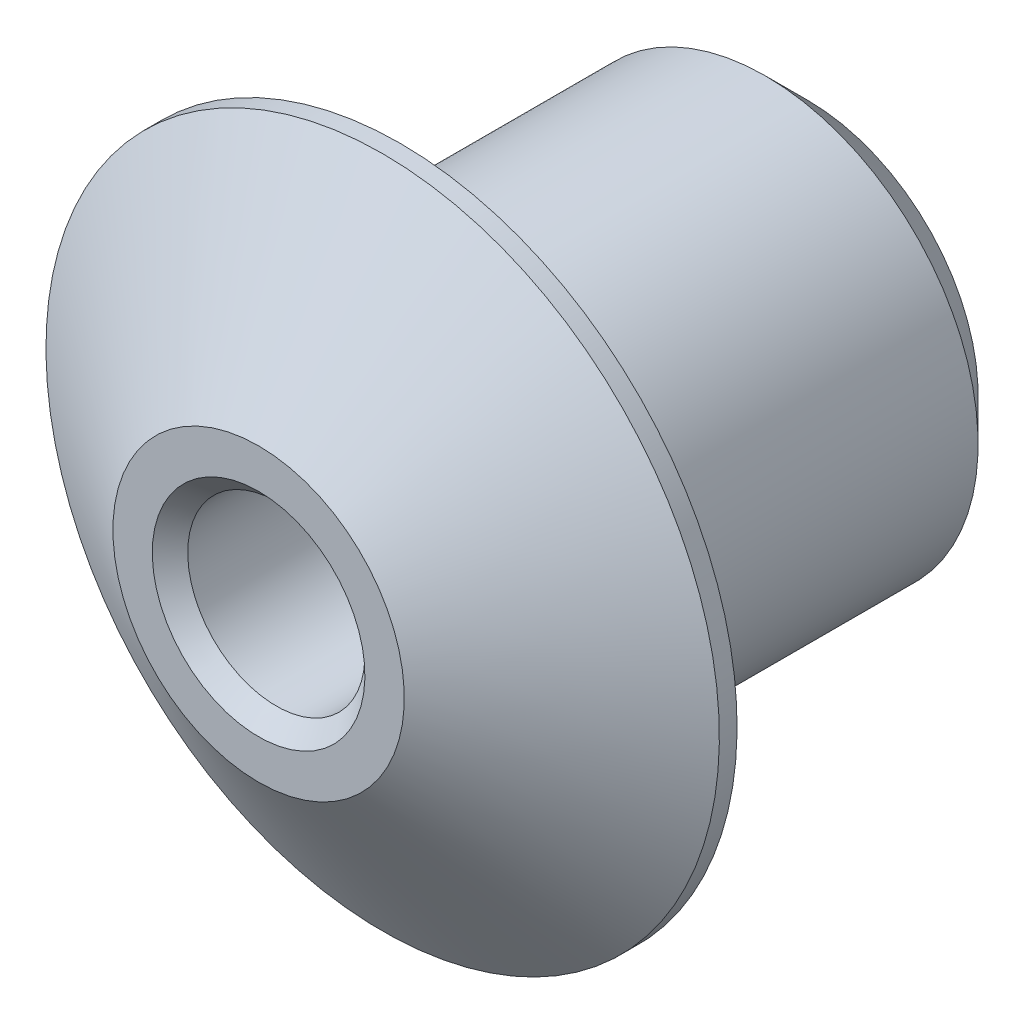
ISO-10303-21;
HEADER;
FILE_DESCRIPTION(('STEP AP214'),'2;1');
FILE_NAME('part.step','',(''),(''),'','','');
FILE_SCHEMA(('AUTOMOTIVE_DESIGN { 1 0 10303 214 1 1 1 1 }'));
ENDSEC;
DATA;
#1=APPLICATION_CONTEXT('core data for automotive mechanical design processes');
#2=APPLICATION_PROTOCOL_DEFINITION('international standard','automotive_design',2000,#1);
#3=PRODUCT_CONTEXT('',#1,'mechanical');
#4=PRODUCT('Part','Part','',(#3));
#5=PRODUCT_RELATED_PRODUCT_CATEGORY('part','',(#4));
#6=PRODUCT_DEFINITION_FORMATION('','',#4);
#7=PRODUCT_DEFINITION_CONTEXT('part definition',#1,'design');
#8=PRODUCT_DEFINITION('design','',#6,#7);
#9=PRODUCT_DEFINITION_SHAPE('','',#8);
#10=(LENGTH_UNIT() NAMED_UNIT(*) SI_UNIT(.MILLI.,.METRE.));
#11=(NAMED_UNIT(*) PLANE_ANGLE_UNIT() SI_UNIT($,.RADIAN.));
#12=(NAMED_UNIT(*) SI_UNIT($,.STERADIAN.) SOLID_ANGLE_UNIT());
#13=UNCERTAINTY_MEASURE_WITH_UNIT(LENGTH_MEASURE(1.E-05),#10,'distance_accuracy_value','');
#14=(GEOMETRIC_REPRESENTATION_CONTEXT(3) GLOBAL_UNCERTAINTY_ASSIGNED_CONTEXT((#13)) GLOBAL_UNIT_ASSIGNED_CONTEXT((#10,
#11,#12)) REPRESENTATION_CONTEXT('',''));
#15=CARTESIAN_POINT('',(0.,0.,0.));
#16=DIRECTION('',(0.,0.,1.));
#17=DIRECTION('',(1.,0.,0.));
#18=AXIS2_PLACEMENT_3D('',#15,#16,#17);
#19=CARTESIAN_POINT('',(0.,0.,-6.));
#20=DIRECTION('',(0.,0.,1.));
#21=DIRECTION('',(0.,-1.,0.));
#22=AXIS2_PLACEMENT_3D('',#19,#20,#21);
#23=CONICAL_SURFACE('',#22,2.5,0.872664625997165);
#24=CARTESIAN_POINT('',(2.,2.6451157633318,-5.31519583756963));
#25=CARTESIAN_POINT('',(2.,2.57786167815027,-5.36019912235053));
#26=CARTESIAN_POINT('',(2.,2.51032536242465,-5.40478738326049));
#27=CARTESIAN_POINT('',(2.,2.37456315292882,-5.49293207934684));
#28=CARTESIAN_POINT('',(2.,2.30633711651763,-5.53648829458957));
#29=CARTESIAN_POINT('',(2.,2.16862031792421,-5.62264719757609));
#30=CARTESIAN_POINT('',(2.,2.09912405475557,-5.66524112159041));
#31=CARTESIAN_POINT('',(2.,1.95919860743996,-5.74886273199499));
#32=CARTESIAN_POINT('',(2.,1.8887694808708,-5.7898905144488));
#33=CARTESIAN_POINT('',(2.,1.74286272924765,-5.87223695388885));
#34=CARTESIAN_POINT('',(2.,1.66732223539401,-5.91344478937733));
#35=CARTESIAN_POINT('',(2.,1.51480981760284,-5.99311608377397));
#36=CARTESIAN_POINT('',(2.,1.43783806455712,-6.03157986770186));
#37=CARTESIAN_POINT('',(2.,1.28242402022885,-6.10491089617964));
#38=CARTESIAN_POINT('',(2.,1.20398594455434,-6.13978699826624));
#39=CARTESIAN_POINT('',(2.,1.04528210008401,-6.20505682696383));
#40=CARTESIAN_POINT('',(2.,0.96501710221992,-6.23545240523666));
#41=CARTESIAN_POINT('',(2.,0.804631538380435,-6.28984541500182));
#42=CARTESIAN_POINT('',(2.,0.724560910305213,-6.31398797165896));
#43=CARTESIAN_POINT('',(2.,0.562674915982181,-6.35559635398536));
#44=CARTESIAN_POINT('',(2.,0.480859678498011,-6.37306267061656));
#45=CARTESIAN_POINT('',(2.,0.317480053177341,-6.3998403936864));
#46=CARTESIAN_POINT('',(2.,0.23594065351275,-6.4093010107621));
#47=CARTESIAN_POINT('',(2.,0.0723155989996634,-6.41984676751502));
#48=CARTESIAN_POINT('',(2.,-0.00976998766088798,-6.42093293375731));
#49=CARTESIAN_POINT('',(2.,-0.167433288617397,-6.41487856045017));
#50=CARTESIAN_POINT('',(2.,-0.243035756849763,-6.40835113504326));
#51=CARTESIAN_POINT('',(2.,-0.393338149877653,-6.38853746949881));
#52=CARTESIAN_POINT('',(2.,-0.468038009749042,-6.37525074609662));
#53=CARTESIAN_POINT('',(2.,-0.617702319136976,-6.34240168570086));
#54=CARTESIAN_POINT('',(2.,-0.692638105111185,-6.32271090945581));
#55=CARTESIAN_POINT('',(2.,-0.840916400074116,-6.27816929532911));
#56=CARTESIAN_POINT('',(2.,-0.914259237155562,-6.25331953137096));
#57=CARTESIAN_POINT('',(2.,-1.12888197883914,-6.17365164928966));
#58=CARTESIAN_POINT('',(2.,-1.2679570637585,-6.11292450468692));
#59=CARTESIAN_POINT('',(2.,-1.54119296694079,-5.98115937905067));
#60=CARTESIAN_POINT('',(2.,-1.67534617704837,-5.91010621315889));
#61=CARTESIAN_POINT('',(2.,-1.94067766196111,-5.76081388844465));
#62=CARTESIAN_POINT('',(2.,-2.07183160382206,-5.68253191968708));
#63=CARTESIAN_POINT('',(2.,-2.33119088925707,-5.52144420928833));
#64=CARTESIAN_POINT('',(2.,-2.45939795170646,-5.43864120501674));
#65=CARTESIAN_POINT('',(2.,-2.69991940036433,-5.27897701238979));
#66=CARTESIAN_POINT('',(2.,-2.81245201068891,-5.20244273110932));
#67=CARTESIAN_POINT('',(2.,-3.03621517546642,-5.04746117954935));
#68=CARTESIAN_POINT('',(2.,-3.1474455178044,-4.96901360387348));
#69=CARTESIAN_POINT('',(2.,-3.36737393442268,-4.81174090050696));
#70=CARTESIAN_POINT('',(2.,-3.47608592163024,-4.7329351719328));
#71=CARTESIAN_POINT('',(2.,-3.6926625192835,-4.57422682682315));
#72=CARTESIAN_POINT('',(2.,-3.80052734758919,-4.49432450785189));
#73=CARTESIAN_POINT('',(2.,-3.90807857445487,-4.41400821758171));
#74=B_SPLINE_CURVE_WITH_KNOTS('',3,(#24,#25,#26,#27,#28,#29,#30,#31,#32,#33,#34,#35,#36,#37,#38,
#39,#40,#41,#42,#43,#44,#45,#46,#47,#48,#49,#50,#51,#52,#53,#54,#55,#56,#57,#58,#59,#60,#61,#62,
#63,#64,#65,#66,#67,#68,#69,#70,#71,#72,#73),.UNSPECIFIED.,.F.,.F.,(4,2,2,2,2,2,2,2,2,2,2,2,2,2,
2,2,2,2,2,2,2,2,2,2,4),(0.,0.242770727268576,0.485592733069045,0.730107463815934,
0.974607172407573,1.23271036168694,1.49078292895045,1.74820223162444,2.005514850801,
2.25617358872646,2.50681388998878,2.75267286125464,2.99850169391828,3.22582565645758,
3.45316587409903,3.68538017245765,3.91754618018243,4.37205400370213,4.82723709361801,
5.28531377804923,5.74311611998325,6.15136831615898,6.55968610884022,6.9624907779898,
7.36518822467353),.UNSPECIFIED.);
#75=CARTESIAN_POINT('',(2.,1.15470053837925,-6.15993148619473));
#76=VERTEX_POINT('',#75);
#77=CARTESIAN_POINT('',(2.,-1.15470053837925,-6.15993148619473));
#78=VERTEX_POINT('',#77);
#79=EDGE_CURVE('E142',#76,#78,#74,.T.);
#80=ORIENTED_EDGE('',*,*,#79,.T.);
#81=CARTESIAN_POINT('',(2.0002,-1.15458506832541,-6.15983458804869));
#82=CARTESIAN_POINT('',(1.93287475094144,-1.19345531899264,-6.19243850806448));
#83=CARTESIAN_POINT('',(1.86472971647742,-1.23279887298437,-6.22300460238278));
#84=CARTESIAN_POINT('',(1.72660712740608,-1.31254398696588,-6.27888502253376));
#85=CARTESIAN_POINT('',(1.65662434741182,-1.3529485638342,-6.30418199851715));
#86=CARTESIAN_POINT('',(1.51571866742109,-1.4343004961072,-6.34791885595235));
#87=CARTESIAN_POINT('',(1.44481025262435,-1.47523948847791,-6.36641943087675));
#88=CARTESIAN_POINT('',(1.30186028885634,-1.55777168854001,-6.39559665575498));
#89=CARTESIAN_POINT('',(1.22982023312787,-1.59936403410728,-6.40628285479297));
#90=CARTESIAN_POINT('',(1.0839081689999,-1.68360640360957,-6.41908026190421));
#91=CARTESIAN_POINT('',(1.01002594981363,-1.7262623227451,-6.42104100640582));
#92=CARTESIAN_POINT('',(0.862481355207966,-1.81144723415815,-6.41578621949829));
#93=CARTESIAN_POINT('',(0.78881909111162,-1.8539761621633,-6.40856664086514));
#94=CARTESIAN_POINT('',(0.642524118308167,-1.93843960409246,-6.38561026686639));
#95=CARTESIAN_POINT('',(0.569891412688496,-1.98037411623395,-6.36987344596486));
#96=CARTESIAN_POINT('',(0.426099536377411,-2.06339239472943,-6.33109503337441));
#97=CARTESIAN_POINT('',(0.354941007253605,-2.1044757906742,-6.30805032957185));
#98=CARTESIAN_POINT('',(0.236290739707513,-2.17297855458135,-6.2641669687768));
#99=CARTESIAN_POINT('',(0.188354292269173,-2.20065467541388,-6.24489060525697));
#100=CARTESIAN_POINT('',(0.0934234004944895,-2.2554630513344,-6.20401277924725));
#101=CARTESIAN_POINT('',(0.0464262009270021,-2.28259689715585,-6.18241987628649));
#102=CARTESIAN_POINT('',(-0.000200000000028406,-2.30951654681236,-6.15983458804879));
#103=B_SPLINE_CURVE_WITH_KNOTS('',3,(#81,#82,#83,#84,#85,#86,#87,#88,#89,#90,#91,#92,#93,#94,
#95,#96,#97,#98,#99,#100,#101,#102),.UNSPECIFIED.,.F.,.F.,(4,2,2,2,2,2,2,2,2,2,4),(0.,
0.253000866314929,0.506822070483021,0.758318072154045,1.00950623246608,1.2650095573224,
1.52062556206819,1.77624233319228,2.0319681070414,2.20775392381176,2.38291123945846),.UNSPECIFIED.);
#104=CARTESIAN_POINT('',(0.,-2.30940107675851,-6.15993148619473));
#105=VERTEX_POINT('',#104);
#106=EDGE_CURVE('E104',#78,#105,#103,.T.);
#107=ORIENTED_EDGE('',*,*,#106,.T.);
#108=CARTESIAN_POINT('',(0.0002,-2.30951654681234,-6.15983458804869));
#109=CARTESIAN_POINT('',(-0.0671252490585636,-2.27064629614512,-6.19243850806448));
#110=CARTESIAN_POINT('',(-0.135270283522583,-2.23130274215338,-6.22300460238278));
#111=CARTESIAN_POINT('',(-0.273392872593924,-2.15155762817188,-6.27888502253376));
#112=CARTESIAN_POINT('',(-0.343375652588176,-2.11115305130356,-6.30418199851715));
#113=CARTESIAN_POINT('',(-0.484281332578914,-2.02980111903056,-6.34791885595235));
#114=CARTESIAN_POINT('',(-0.555189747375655,-1.98886212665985,-6.36641943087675));
#115=CARTESIAN_POINT('',(-0.698139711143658,-1.90632992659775,-6.39559665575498));
#116=CARTESIAN_POINT('',(-0.770179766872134,-1.86473758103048,-6.40628285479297));
#117=CARTESIAN_POINT('',(-0.9160918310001,-1.78049521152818,-6.41908026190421));
#118=CARTESIAN_POINT('',(-0.98997405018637,-1.73783929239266,-6.42104100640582));
#119=CARTESIAN_POINT('',(-1.13751864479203,-1.6526543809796,-6.41578621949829));
#120=CARTESIAN_POINT('',(-1.21118090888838,-1.61012545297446,-6.40856664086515));
#121=CARTESIAN_POINT('',(-1.35747588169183,-1.5256620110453,-6.3856102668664));
#122=CARTESIAN_POINT('',(-1.4301085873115,-1.48372749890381,-6.36987344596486));
#123=CARTESIAN_POINT('',(-1.57390046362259,-1.40070922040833,-6.33109503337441));
#124=CARTESIAN_POINT('',(-1.64505899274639,-1.35962582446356,-6.30805032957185));
#125=CARTESIAN_POINT('',(-1.76370926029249,-1.2911230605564,-6.2641669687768));
#126=CARTESIAN_POINT('',(-1.81164570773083,-1.26344693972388,-6.24489060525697));
#127=CARTESIAN_POINT('',(-1.90657659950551,-1.20863856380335,-6.20401277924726));
#128=CARTESIAN_POINT('',(-1.953573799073,-1.18150471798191,-6.18241987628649));
#129=CARTESIAN_POINT('',(-2.00020000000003,-1.1545850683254,-6.15983458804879));
#130=B_SPLINE_CURVE_WITH_KNOTS('',3,(#108,#109,#110,#111,#112,#113,#114,#115,#116,#117,#118,
#119,#120,#121,#122,#123,#124,#125,#126,#127,#128,#129),.UNSPECIFIED.,.F.,.F.,(4,2,2,2,2,2,2,2,
2,2,4),(0.,0.253000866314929,0.506822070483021,0.758318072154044,1.00950623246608,
1.2650095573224,1.52062556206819,1.77624233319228,2.0319681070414,2.20775392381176,
2.38291123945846),.UNSPECIFIED.);
#131=CARTESIAN_POINT('',(-2.,-1.15470053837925,-6.15993148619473));
#132=VERTEX_POINT('',#131);
#133=EDGE_CURVE('E153',#105,#132,#130,.T.);
#134=ORIENTED_EDGE('',*,*,#133,.T.);
#135=CARTESIAN_POINT('',(-2.,2.6451157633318,-5.31519583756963));
#136=CARTESIAN_POINT('',(-2.,2.57786167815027,-5.36019912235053));
#137=CARTESIAN_POINT('',(-2.,2.51032536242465,-5.40478738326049));
#138=CARTESIAN_POINT('',(-2.,2.37456315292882,-5.49293207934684));
#139=CARTESIAN_POINT('',(-2.,2.30633711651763,-5.53648829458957));
#140=CARTESIAN_POINT('',(-2.,2.16862031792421,-5.62264719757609));
#141=CARTESIAN_POINT('',(-2.,2.09912405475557,-5.66524112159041));
#142=CARTESIAN_POINT('',(-2.,1.95919860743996,-5.74886273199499));
#143=CARTESIAN_POINT('',(-2.,1.8887694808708,-5.7898905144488));
#144=CARTESIAN_POINT('',(-2.,1.74286272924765,-5.87223695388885));
#145=CARTESIAN_POINT('',(-2.,1.66732223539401,-5.91344478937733));
#146=CARTESIAN_POINT('',(-2.,1.51480981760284,-5.99311608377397));
#147=CARTESIAN_POINT('',(-2.,1.43783806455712,-6.03157986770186));
#148=CARTESIAN_POINT('',(-2.,1.28242402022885,-6.10491089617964));
#149=CARTESIAN_POINT('',(-2.,1.20398594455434,-6.13978699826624));
#150=CARTESIAN_POINT('',(-2.,1.04528210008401,-6.20505682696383));
#151=CARTESIAN_POINT('',(-2.,0.96501710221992,-6.23545240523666));
#152=CARTESIAN_POINT('',(-2.,0.804631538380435,-6.28984541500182));
#153=CARTESIAN_POINT('',(-2.,0.724560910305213,-6.31398797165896));
#154=CARTESIAN_POINT('',(-2.,0.562674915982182,-6.35559635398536));
#155=CARTESIAN_POINT('',(-2.,0.480859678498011,-6.37306267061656));
#156=CARTESIAN_POINT('',(-2.,0.317480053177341,-6.3998403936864));
#157=CARTESIAN_POINT('',(-2.,0.235940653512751,-6.4093010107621));
#158=CARTESIAN_POINT('',(-2.,0.0723155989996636,-6.41984676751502));
#159=CARTESIAN_POINT('',(-2.,-0.00976998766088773,-6.42093293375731));
#160=CARTESIAN_POINT('',(-2.,-0.167433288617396,-6.41487856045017));
#161=CARTESIAN_POINT('',(-2.,-0.243035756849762,-6.40835113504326));
#162=CARTESIAN_POINT('',(-2.,-0.393338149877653,-6.38853746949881));
#163=CARTESIAN_POINT('',(-2.,-0.468038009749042,-6.37525074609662));
#164=CARTESIAN_POINT('',(-2.,-0.617702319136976,-6.34240168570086));
#165=CARTESIAN_POINT('',(-2.,-0.692638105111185,-6.32271090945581));
#166=CARTESIAN_POINT('',(-2.,-0.840916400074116,-6.27816929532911));
#167=CARTESIAN_POINT('',(-2.,-0.914259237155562,-6.25331953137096));
#168=CARTESIAN_POINT('',(-2.,-1.12888197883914,-6.17365164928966));
#169=CARTESIAN_POINT('',(-2.,-1.2679570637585,-6.11292450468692));
#170=CARTESIAN_POINT('',(-2.,-1.54119296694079,-5.98115937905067));
#171=CARTESIAN_POINT('',(-2.,-1.67534617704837,-5.91010621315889));
#172=CARTESIAN_POINT('',(-2.,-1.94067766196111,-5.76081388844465));
#173=CARTESIAN_POINT('',(-2.,-2.07183160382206,-5.68253191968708));
#174=CARTESIAN_POINT('',(-2.,-2.33119088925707,-5.52144420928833));
#175=CARTESIAN_POINT('',(-2.,-2.45939795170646,-5.43864120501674));
#176=CARTESIAN_POINT('',(-2.,-2.69991940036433,-5.27897701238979));
#177=CARTESIAN_POINT('',(-2.,-2.81245201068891,-5.20244273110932));
#178=CARTESIAN_POINT('',(-2.,-3.03621517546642,-5.04746117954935));
#179=CARTESIAN_POINT('',(-2.,-3.1474455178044,-4.96901360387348));
#180=CARTESIAN_POINT('',(-2.,-3.36737393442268,-4.81174090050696));
#181=CARTESIAN_POINT('',(-2.,-3.47608592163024,-4.7329351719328));
#182=CARTESIAN_POINT('',(-2.,-3.6926625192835,-4.57422682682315));
#183=CARTESIAN_POINT('',(-2.,-3.80052734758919,-4.49432450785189));
#184=CARTESIAN_POINT('',(-2.,-3.90807857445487,-4.41400821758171));
#185=B_SPLINE_CURVE_WITH_KNOTS('',3,(#135,#136,#137,#138,#139,#140,#141,#142,#143,#144,#145,
#146,#147,#148,#149,#150,#151,#152,#153,#154,#155,#156,#157,#158,#159,#160,#161,#162,#163,#164,
#165,#166,#167,#168,#169,#170,#171,#172,#173,#174,#175,#176,#177,#178,#179,#180,#181,#182,#183,
#184),.UNSPECIFIED.,.F.,.F.,(4,2,2,2,2,2,2,2,2,2,2,2,2,2,2,2,2,2,2,2,2,2,2,2,4),(0.,
0.242770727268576,0.485592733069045,0.730107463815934,0.974607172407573,1.23271036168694,
1.49078292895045,1.74820223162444,2.005514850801,2.25617358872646,2.50681388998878,
2.75267286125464,2.99850169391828,3.22582565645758,3.45316587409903,3.68538017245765,
3.91754618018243,4.37205400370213,4.82723709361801,5.28531377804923,5.74311611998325,
6.15136831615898,6.55968610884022,6.9624907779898,7.36518822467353),.UNSPECIFIED.);
#186=CARTESIAN_POINT('',(-2.,1.15470053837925,-6.15993148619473));
#187=VERTEX_POINT('',#186);
#188=EDGE_CURVE('E78',#132,#187,#185,.F.);
#189=ORIENTED_EDGE('',*,*,#188,.T.);
#190=CARTESIAN_POINT('',(-2.0002,1.15458506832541,-6.15983458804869));
#191=CARTESIAN_POINT('',(-1.93287475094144,1.19345531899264,-6.19243850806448));
#192=CARTESIAN_POINT('',(-1.86472971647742,1.23279887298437,-6.22300460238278));
#193=CARTESIAN_POINT('',(-1.72660712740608,1.31254398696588,-6.27888502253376));
#194=CARTESIAN_POINT('',(-1.65662434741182,1.3529485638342,-6.30418199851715));
#195=CARTESIAN_POINT('',(-1.51571866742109,1.4343004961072,-6.34791885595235));
#196=CARTESIAN_POINT('',(-1.44481025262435,1.47523948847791,-6.36641943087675));
#197=CARTESIAN_POINT('',(-1.30186028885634,1.55777168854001,-6.39559665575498));
#198=CARTESIAN_POINT('',(-1.22982023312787,1.59936403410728,-6.40628285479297));
#199=CARTESIAN_POINT('',(-1.0839081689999,1.68360640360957,-6.41908026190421));
#200=CARTESIAN_POINT('',(-1.01002594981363,1.7262623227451,-6.42104100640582));
#201=CARTESIAN_POINT('',(-0.862481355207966,1.81144723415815,-6.41578621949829));
#202=CARTESIAN_POINT('',(-0.78881909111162,1.8539761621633,-6.40856664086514));
#203=CARTESIAN_POINT('',(-0.642524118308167,1.93843960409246,-6.38561026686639));
#204=CARTESIAN_POINT('',(-0.569891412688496,1.98037411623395,-6.36987344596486));
#205=CARTESIAN_POINT('',(-0.426099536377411,2.06339239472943,-6.33109503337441));
#206=CARTESIAN_POINT('',(-0.354941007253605,2.1044757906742,-6.30805032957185));
#207=CARTESIAN_POINT('',(-0.236290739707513,2.17297855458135,-6.2641669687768));
#208=CARTESIAN_POINT('',(-0.188354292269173,2.20065467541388,-6.24489060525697));
#209=CARTESIAN_POINT('',(-0.0934234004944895,2.2554630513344,-6.20401277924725));
#210=CARTESIAN_POINT('',(-0.0464262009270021,2.28259689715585,-6.18241987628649));
#211=CARTESIAN_POINT('',(0.000200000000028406,2.30951654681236,-6.15983458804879));
#212=B_SPLINE_CURVE_WITH_KNOTS('',3,(#190,#191,#192,#193,#194,#195,#196,#197,#198,#199,#200,
#201,#202,#203,#204,#205,#206,#207,#208,#209,#210,#211),.UNSPECIFIED.,.F.,.F.,(4,2,2,2,2,2,2,2,
2,2,4),(0.,0.253000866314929,0.506822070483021,0.758318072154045,1.00950623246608,
1.2650095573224,1.52062556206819,1.77624233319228,2.0319681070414,2.20775392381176,
2.38291123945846),.UNSPECIFIED.);
#213=CARTESIAN_POINT('',(0.,2.30940107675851,-6.15993148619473));
#214=VERTEX_POINT('',#213);
#215=EDGE_CURVE('E29',#187,#214,#212,.T.);
#216=ORIENTED_EDGE('',*,*,#215,.T.);
#217=CARTESIAN_POINT('',(-0.0002,2.30951654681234,-6.15983458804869));
#218=CARTESIAN_POINT('',(0.0671252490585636,2.27064629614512,-6.19243850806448));
#219=CARTESIAN_POINT('',(0.135270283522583,2.23130274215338,-6.22300460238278));
#220=CARTESIAN_POINT('',(0.273392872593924,2.15155762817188,-6.27888502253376));
#221=CARTESIAN_POINT('',(0.343375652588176,2.11115305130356,-6.30418199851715));
#222=CARTESIAN_POINT('',(0.484281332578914,2.02980111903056,-6.34791885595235));
#223=CARTESIAN_POINT('',(0.555189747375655,1.98886212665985,-6.36641943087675));
#224=CARTESIAN_POINT('',(0.698139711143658,1.90632992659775,-6.39559665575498));
#225=CARTESIAN_POINT('',(0.770179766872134,1.86473758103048,-6.40628285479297));
#226=CARTESIAN_POINT('',(0.9160918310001,1.78049521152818,-6.41908026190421));
#227=CARTESIAN_POINT('',(0.98997405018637,1.73783929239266,-6.42104100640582));
#228=CARTESIAN_POINT('',(1.13751864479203,1.6526543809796,-6.41578621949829));
#229=CARTESIAN_POINT('',(1.21118090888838,1.61012545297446,-6.40856664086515));
#230=CARTESIAN_POINT('',(1.35747588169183,1.5256620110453,-6.3856102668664));
#231=CARTESIAN_POINT('',(1.4301085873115,1.48372749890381,-6.36987344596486));
#232=CARTESIAN_POINT('',(1.57390046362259,1.40070922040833,-6.33109503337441));
#233=CARTESIAN_POINT('',(1.64505899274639,1.35962582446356,-6.30805032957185));
#234=CARTESIAN_POINT('',(1.76370926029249,1.2911230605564,-6.2641669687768));
#235=CARTESIAN_POINT('',(1.81164570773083,1.26344693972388,-6.24489060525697));
#236=CARTESIAN_POINT('',(1.90657659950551,1.20863856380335,-6.20401277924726));
#237=CARTESIAN_POINT('',(1.953573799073,1.18150471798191,-6.18241987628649));
#238=CARTESIAN_POINT('',(2.00020000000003,1.1545850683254,-6.15983458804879));
#239=B_SPLINE_CURVE_WITH_KNOTS('',3,(#217,#218,#219,#220,#221,#222,#223,#224,#225,#226,#227,
#228,#229,#230,#231,#232,#233,#234,#235,#236,#237,#238),.UNSPECIFIED.,.F.,.F.,(4,2,2,2,2,2,2,2,
2,2,4),(0.,0.253000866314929,0.506822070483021,0.758318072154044,1.00950623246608,
1.2650095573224,1.52062556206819,1.77624233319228,2.0319681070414,2.20775392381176,
2.38291123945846),.UNSPECIFIED.);
#240=EDGE_CURVE('E121',#214,#76,#239,.T.);
#241=ORIENTED_EDGE('',*,*,#240,.T.);
#242=EDGE_LOOP('',(#80,#107,#134,#189,#216,#241));
#243=FACE_BOUND('',#242,.T.);
#244=CARTESIAN_POINT('',(0.,0.,-6.));
#245=DIRECTION('',(0.,0.,-1.));
#246=DIRECTION('',(0.,1.,0.));
#247=AXIS2_PLACEMENT_3D('',#244,#245,#246);
#248=CIRCLE('',#247,2.5);
#249=CARTESIAN_POINT('',(0.,2.5,-6.));
#250=VERTEX_POINT('',#249);
#251=EDGE_CURVE('E214',#250,#250,#248,.T.);
#252=ORIENTED_EDGE('',*,*,#251,.F.);
#253=EDGE_LOOP('',(#252));
#254=FACE_BOUND('',#253,.T.);
#255=ADVANCED_FACE('F14',(#243,#254),#23,.F.);
#256=CARTESIAN_POINT('',(2.,0.,-11.5));
#257=DIRECTION('',(0.,0.,-1.));
#258=DIRECTION('',(0.,1.,0.));
#259=AXIS2_PLACEMENT_3D('',#256,#257,#258);
#260=PLANE('',#259);
#261=CARTESIAN_POINT('',(0.,0.,-11.5));
#262=DIRECTION('',(0.,0.,-1.));
#263=DIRECTION('',(0.,1.,0.));
#264=AXIS2_PLACEMENT_3D('',#261,#262,#263);
#265=CIRCLE('',#264,4.8);
#266=CARTESIAN_POINT('',(0.,4.8,-11.5));
#267=VERTEX_POINT('',#266);
#268=EDGE_CURVE('E88',#267,#267,#265,.T.);
#269=ORIENTED_EDGE('',*,*,#268,.T.);
#270=EDGE_LOOP('',(#269));
#271=FACE_BOUND('',#270,.T.);
#272=DIRECTION('',(-0.866025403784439,-0.5,0.));
#273=VECTOR('',#272,1.);
#274=CARTESIAN_POINT('',(0.5,2.59807621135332,-11.5));
#275=LINE('',#274,#273);
#276=CARTESIAN_POINT('',(0.,2.30940107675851,-11.5));
#277=VERTEX_POINT('',#276);
#278=CARTESIAN_POINT('',(-2.,1.15470053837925,-11.5));
#279=VERTEX_POINT('',#278);
#280=EDGE_CURVE('E83',#277,#279,#275,.T.);
#281=ORIENTED_EDGE('',*,*,#280,.T.);
#282=DIRECTION('',(0.,-1.,0.));
#283=VECTOR('',#282,1.);
#284=CARTESIAN_POINT('',(-2.,0.,-11.5));
#285=LINE('',#284,#283);
#286=CARTESIAN_POINT('',(-2.,-1.15470053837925,-11.5));
#287=VERTEX_POINT('',#286);
#288=EDGE_CURVE('E9',#279,#287,#285,.T.);
#289=ORIENTED_EDGE('',*,*,#288,.T.);
#290=DIRECTION('',(0.866025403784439,-0.5,0.));
#291=VECTOR('',#290,1.);
#292=CARTESIAN_POINT('',(0.5,-2.59807621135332,-11.5));
#293=LINE('',#292,#291);
#294=CARTESIAN_POINT('',(0.,-2.30940107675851,-11.5));
#295=VERTEX_POINT('',#294);
#296=EDGE_CURVE('E22',#287,#295,#293,.T.);
#297=ORIENTED_EDGE('',*,*,#296,.T.);
#298=DIRECTION('',(0.866025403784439,0.5,0.));
#299=VECTOR('',#298,1.);
#300=CARTESIAN_POINT('',(2.5,-0.866025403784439,-11.5));
#301=LINE('',#300,#299);
#302=CARTESIAN_POINT('',(2.,-1.15470053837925,-11.5));
#303=VERTEX_POINT('',#302);
#304=EDGE_CURVE('E75',#295,#303,#301,.T.);
#305=ORIENTED_EDGE('',*,*,#304,.T.);
#306=DIRECTION('',(0.,1.,0.));
#307=VECTOR('',#306,1.);
#308=CARTESIAN_POINT('',(2.,0.,-11.5));
#309=LINE('',#308,#307);
#310=CARTESIAN_POINT('',(2.,1.15470053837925,-11.5));
#311=VERTEX_POINT('',#310);
#312=EDGE_CURVE('E90',#303,#311,#309,.T.);
#313=ORIENTED_EDGE('',*,*,#312,.T.);
#314=DIRECTION('',(-0.866025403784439,0.5,0.));
#315=VECTOR('',#314,1.);
#316=CARTESIAN_POINT('',(2.5,0.866025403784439,-11.5));
#317=LINE('',#316,#315);
#318=EDGE_CURVE('E85',#311,#277,#317,.T.);
#319=ORIENTED_EDGE('',*,*,#318,.T.);
#320=EDGE_LOOP('',(#281,#289,#297,#305,#313,#319));
#321=FACE_BOUND('',#320,.T.);
#322=ADVANCED_FACE('F81',(#271,#321),#260,.T.);
#323=CARTESIAN_POINT('',(0.,0.,-11.5));
#324=DIRECTION('',(0.,0.,1.));
#325=DIRECTION('',(0.,-1.,0.));
#326=AXIS2_PLACEMENT_3D('',#323,#324,#325);
#327=CONICAL_SURFACE('',#326,4.8,0.785398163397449);
#328=CARTESIAN_POINT('',(0.,0.,-10.3));
#329=DIRECTION('',(0.,0.,-1.));
#330=DIRECTION('',(0.,1.,0.));
#331=AXIS2_PLACEMENT_3D('',#328,#329,#330);
#332=CIRCLE('',#331,6.);
#333=CARTESIAN_POINT('',(0.,6.,-10.3));
#334=VERTEX_POINT('',#333);
#335=EDGE_CURVE('E93',#334,#334,#332,.T.);
#336=ORIENTED_EDGE('',*,*,#335,.T.);
#337=EDGE_LOOP('',(#336));
#338=FACE_BOUND('',#337,.T.);
#339=ORIENTED_EDGE('',*,*,#268,.F.);
#340=EDGE_LOOP('',(#339));
#341=FACE_BOUND('',#340,.T.);
#342=ADVANCED_FACE('F197',(#338,#341),#327,.T.);
#343=CARTESIAN_POINT('',(0.,0.,-11.5));
#344=DIRECTION('',(0.,0.,-1.));
#345=DIRECTION('',(0.,1.,0.));
#346=AXIS2_PLACEMENT_3D('',#343,#344,#345);
#347=CYLINDRICAL_SURFACE('',#346,6.);
#348=CARTESIAN_POINT('',(0.,0.,0.));
#349=DIRECTION('',(0.,0.,-1.));
#350=DIRECTION('',(0.,1.,0.));
#351=AXIS2_PLACEMENT_3D('',#348,#349,#350);
#352=CIRCLE('',#351,6.);
#353=CARTESIAN_POINT('',(0.,6.,0.));
#354=VERTEX_POINT('',#353);
#355=EDGE_CURVE('E231',#354,#354,#352,.T.);
#356=ORIENTED_EDGE('',*,*,#355,.T.);
#357=EDGE_LOOP('',(#356));
#358=FACE_BOUND('',#357,.T.);
#359=ORIENTED_EDGE('',*,*,#335,.F.);
#360=EDGE_LOOP('',(#359));
#361=FACE_BOUND('',#360,.T.);
#362=ADVANCED_FACE('F193',(#358,#361),#347,.T.);
#363=CARTESIAN_POINT('',(6.,0.,0.));
#364=DIRECTION('',(0.,0.,-1.));
#365=DIRECTION('',(0.,1.,0.));
#366=AXIS2_PLACEMENT_3D('',#363,#364,#365);
#367=PLANE('',#366);
#368=CARTESIAN_POINT('',(0.,0.,0.));
#369=DIRECTION('',(0.,0.,-1.));
#370=DIRECTION('',(0.,1.,0.));
#371=AXIS2_PLACEMENT_3D('',#368,#369,#370);
#372=CIRCLE('',#371,9.5);
#373=CARTESIAN_POINT('',(0.,9.5,0.));
#374=VERTEX_POINT('',#373);
#375=EDGE_CURVE('E228',#374,#374,#372,.T.);
#376=ORIENTED_EDGE('',*,*,#375,.T.);
#377=EDGE_LOOP('',(#376));
#378=FACE_BOUND('',#377,.T.);
#379=ORIENTED_EDGE('',*,*,#355,.F.);
#380=EDGE_LOOP('',(#379));
#381=FACE_BOUND('',#380,.T.);
#382=ADVANCED_FACE('F189',(#378,#381),#367,.T.);
#383=CARTESIAN_POINT('',(0.,0.,-11.5));
#384=DIRECTION('',(0.,0.,-1.));
#385=DIRECTION('',(0.,1.,0.));
#386=AXIS2_PLACEMENT_3D('',#383,#384,#385);
#387=CYLINDRICAL_SURFACE('',#386,9.5);
#388=CARTESIAN_POINT('',(0.,0.,0.5));
#389=DIRECTION('',(0.,0.,-1.));
#390=DIRECTION('',(0.,1.,0.));
#391=AXIS2_PLACEMENT_3D('',#388,#389,#390);
#392=CIRCLE('',#391,9.5);
#393=CARTESIAN_POINT('',(0.,9.5,0.5));
#394=VERTEX_POINT('',#393);
#395=EDGE_CURVE('E225',#394,#394,#392,.T.);
#396=ORIENTED_EDGE('',*,*,#395,.T.);
#397=EDGE_LOOP('',(#396));
#398=FACE_BOUND('',#397,.T.);
#399=ORIENTED_EDGE('',*,*,#375,.F.);
#400=EDGE_LOOP('',(#399));
#401=FACE_BOUND('',#400,.T.);
#402=ADVANCED_FACE('F185',(#398,#401),#387,.T.);
#403=CARTESIAN_POINT('',(0.,0.,0.5));
#404=DIRECTION('',(0.,0.,-1.));
#405=DIRECTION('',(0.,1.,0.));
#406=AXIS2_PLACEMENT_3D('',#403,#404,#405);
#407=CONICAL_SURFACE('',#406,9.5,0.994837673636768);
#408=CARTESIAN_POINT('',(0.,0.,4.));
#409=DIRECTION('',(0.,0.,-1.));
#410=DIRECTION('',(0.,1.,0.));
#411=AXIS2_PLACEMENT_3D('',#408,#409,#410);
#412=CIRCLE('',#411,4.11047262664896);
#413=CARTESIAN_POINT('',(0.,4.11047262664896,4.));
#414=VERTEX_POINT('',#413);
#415=EDGE_CURVE('E222',#414,#414,#412,.T.);
#416=ORIENTED_EDGE('',*,*,#415,.T.);
#417=EDGE_LOOP('',(#416));
#418=FACE_BOUND('',#417,.T.);
#419=ORIENTED_EDGE('',*,*,#395,.F.);
#420=EDGE_LOOP('',(#419));
#421=FACE_BOUND('',#420,.T.);
#422=ADVANCED_FACE('F181',(#418,#421),#407,.T.);
#423=CARTESIAN_POINT('',(4.11047262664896,0.,4.));
#424=DIRECTION('',(0.,0.,1.));
#425=DIRECTION('',(0.,-1.,0.));
#426=AXIS2_PLACEMENT_3D('',#423,#424,#425);
#427=PLANE('',#426);
#428=CARTESIAN_POINT('',(0.,0.,4.));
#429=DIRECTION('',(0.,0.,-1.));
#430=DIRECTION('',(0.,1.,0.));
#431=AXIS2_PLACEMENT_3D('',#428,#429,#430);
#432=CIRCLE('',#431,3.);
#433=CARTESIAN_POINT('',(0.,3.,4.));
#434=VERTEX_POINT('',#433);
#435=EDGE_CURVE('E217',#434,#434,#432,.T.);
#436=ORIENTED_EDGE('',*,*,#435,.T.);
#437=EDGE_LOOP('',(#436));
#438=FACE_BOUND('',#437,.T.);
#439=ORIENTED_EDGE('',*,*,#415,.F.);
#440=EDGE_LOOP('',(#439));
#441=FACE_BOUND('',#440,.T.);
#442=ADVANCED_FACE('F177',(#438,#441),#427,.T.);
#443=CARTESIAN_POINT('',(0.,0.,4.));
#444=DIRECTION('',(0.,0.,1.));
#445=DIRECTION('',(0.,-1.,0.));
#446=AXIS2_PLACEMENT_3D('',#443,#444,#445);
#447=CONICAL_SURFACE('',#446,3.,0.785398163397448);
#448=CARTESIAN_POINT('',(0.,0.,3.5));
#449=DIRECTION('',(0.,0.,-1.));
#450=DIRECTION('',(0.,1.,0.));
#451=AXIS2_PLACEMENT_3D('',#448,#449,#450);
#452=CIRCLE('',#451,2.5);
#453=CARTESIAN_POINT('',(0.,2.5,3.5));
#454=VERTEX_POINT('',#453);
#455=EDGE_CURVE('E215',#454,#454,#452,.T.);
#456=ORIENTED_EDGE('',*,*,#455,.T.);
#457=EDGE_LOOP('',(#456));
#458=FACE_BOUND('',#457,.T.);
#459=ORIENTED_EDGE('',*,*,#435,.F.);
#460=EDGE_LOOP('',(#459));
#461=FACE_BOUND('',#460,.T.);
#462=ADVANCED_FACE('F173',(#458,#461),#447,.F.);
#463=CARTESIAN_POINT('',(0.,0.,-11.5));
#464=DIRECTION('',(0.,0.,-1.));
#465=DIRECTION('',(0.,1.,0.));
#466=AXIS2_PLACEMENT_3D('',#463,#464,#465);
#467=CYLINDRICAL_SURFACE('',#466,2.5);
#468=ORIENTED_EDGE('',*,*,#251,.T.);
#469=EDGE_LOOP('',(#468));
#470=FACE_BOUND('',#469,.T.);
#471=ORIENTED_EDGE('',*,*,#455,.F.);
#472=EDGE_LOOP('',(#471));
#473=FACE_BOUND('',#472,.T.);
#474=ADVANCED_FACE('F170',(#470,#473),#467,.F.);
#475=CARTESIAN_POINT('',(-2.,1.15470053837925,-6.));
#476=DIRECTION('',(1.,0.,0.));
#477=DIRECTION('',(0.,1.,0.));
#478=AXIS2_PLACEMENT_3D('',#475,#476,#477);
#479=PLANE('',#478);
#480=DIRECTION('',(0.,0.,-1.));
#481=VECTOR('',#480,1.);
#482=CARTESIAN_POINT('',(-2.,-1.15470053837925,-6.));
#483=LINE('',#482,#481);
#484=EDGE_CURVE('E70',#132,#287,#483,.T.);
#485=ORIENTED_EDGE('',*,*,#484,.T.);
#486=ORIENTED_EDGE('',*,*,#288,.F.);
#487=DIRECTION('',(0.,0.,-1.));
#488=VECTOR('',#487,1.);
#489=CARTESIAN_POINT('',(-2.,1.15470053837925,-6.));
#490=LINE('',#489,#488);
#491=EDGE_CURVE('E246',#187,#279,#490,.T.);
#492=ORIENTED_EDGE('',*,*,#491,.F.);
#493=ORIENTED_EDGE('',*,*,#188,.F.);
#494=EDGE_LOOP('',(#485,#486,#492,#493));
#495=FACE_BOUND('',#494,.T.);
#496=ADVANCED_FACE('F77',(#495),#479,.T.);
#497=CARTESIAN_POINT('',(-2.,-1.15470053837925,-6.));
#498=DIRECTION('',(0.5,0.866025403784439,0.));
#499=DIRECTION('',(-0.866025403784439,0.5,0.));
#500=AXIS2_PLACEMENT_3D('',#497,#498,#499);
#501=PLANE('',#500);
#502=DIRECTION('',(0.,0.,-1.));
#503=VECTOR('',#502,1.);
#504=CARTESIAN_POINT('',(0.,-2.30940107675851,-6.));
#505=LINE('',#504,#503);
#506=EDGE_CURVE('E72',#105,#295,#505,.T.);
#507=ORIENTED_EDGE('',*,*,#506,.T.);
#508=ORIENTED_EDGE('',*,*,#296,.F.);
#509=ORIENTED_EDGE('',*,*,#484,.F.);
#510=ORIENTED_EDGE('',*,*,#133,.F.);
#511=EDGE_LOOP('',(#507,#508,#509,#510));
#512=FACE_BOUND('',#511,.T.);
#513=ADVANCED_FACE('F68',(#512),#501,.T.);
#514=CARTESIAN_POINT('',(0.,-2.30940107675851,-6.));
#515=DIRECTION('',(-0.5,0.866025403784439,0.));
#516=DIRECTION('',(-0.866025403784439,-0.5,0.));
#517=AXIS2_PLACEMENT_3D('',#514,#515,#516);
#518=PLANE('',#517);
#519=DIRECTION('',(0.,0.,-1.));
#520=VECTOR('',#519,1.);
#521=CARTESIAN_POINT('',(2.,-1.15470053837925,-6.));
#522=LINE('',#521,#520);
#523=EDGE_CURVE('E103',#78,#303,#522,.T.);
#524=ORIENTED_EDGE('',*,*,#523,.T.);
#525=ORIENTED_EDGE('',*,*,#304,.F.);
#526=ORIENTED_EDGE('',*,*,#506,.F.);
#527=ORIENTED_EDGE('',*,*,#106,.F.);
#528=EDGE_LOOP('',(#524,#525,#526,#527));
#529=FACE_BOUND('',#528,.T.);
#530=ADVANCED_FACE('F100',(#529),#518,.T.);
#531=CARTESIAN_POINT('',(2.,-1.15470053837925,-6.));
#532=DIRECTION('',(-1.,0.,0.));
#533=DIRECTION('',(0.,-1.,0.));
#534=AXIS2_PLACEMENT_3D('',#531,#532,#533);
#535=PLANE('',#534);
#536=DIRECTION('',(0.,0.,-1.));
#537=VECTOR('',#536,1.);
#538=CARTESIAN_POINT('',(2.,1.15470053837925,-6.));
#539=LINE('',#538,#537);
#540=EDGE_CURVE('E107',#76,#311,#539,.T.);
#541=ORIENTED_EDGE('',*,*,#540,.T.);
#542=ORIENTED_EDGE('',*,*,#312,.F.);
#543=ORIENTED_EDGE('',*,*,#523,.F.);
#544=ORIENTED_EDGE('',*,*,#79,.F.);
#545=EDGE_LOOP('',(#541,#542,#543,#544));
#546=FACE_BOUND('',#545,.T.);
#547=ADVANCED_FACE('F135',(#546),#535,.T.);
#548=CARTESIAN_POINT('',(2.,1.15470053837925,-6.));
#549=DIRECTION('',(-0.5,-0.866025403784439,0.));
#550=DIRECTION('',(0.866025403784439,-0.5,0.));
#551=AXIS2_PLACEMENT_3D('',#548,#549,#550);
#552=PLANE('',#551);
#553=DIRECTION('',(0.,0.,-1.));
#554=VECTOR('',#553,1.);
#555=CARTESIAN_POINT('',(0.,2.30940107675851,-6.));
#556=LINE('',#555,#554);
#557=EDGE_CURVE('E111',#214,#277,#556,.T.);
#558=ORIENTED_EDGE('',*,*,#557,.T.);
#559=ORIENTED_EDGE('',*,*,#318,.F.);
#560=ORIENTED_EDGE('',*,*,#540,.F.);
#561=ORIENTED_EDGE('',*,*,#240,.F.);
#562=EDGE_LOOP('',(#558,#559,#560,#561));
#563=FACE_BOUND('',#562,.T.);
#564=ADVANCED_FACE('F131',(#563),#552,.T.);
#565=CARTESIAN_POINT('',(0.,2.30940107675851,-6.));
#566=DIRECTION('',(0.5,-0.866025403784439,0.));
#567=DIRECTION('',(0.866025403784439,0.5,0.));
#568=AXIS2_PLACEMENT_3D('',#565,#566,#567);
#569=PLANE('',#568);
#570=ORIENTED_EDGE('',*,*,#491,.T.);
#571=ORIENTED_EDGE('',*,*,#280,.F.);
#572=ORIENTED_EDGE('',*,*,#557,.F.);
#573=ORIENTED_EDGE('',*,*,#215,.F.);
#574=EDGE_LOOP('',(#570,#571,#572,#573));
#575=FACE_BOUND('',#574,.T.);
#576=ADVANCED_FACE('F128',(#575),#569,.T.);
#577=CLOSED_SHELL('',(#255,#322,#342,#362,#382,#402,#422,#442,#462,#474,#496,#513,#530,#547,
#564,#576));
#578=MANIFOLD_SOLID_BREP('B1',#577);
#579=ADVANCED_BREP_SHAPE_REPRESENTATION('',(#18,#578),#14);
#580=SHAPE_DEFINITION_REPRESENTATION(#9,#579);
ENDSEC;
END-ISO-10303-21;
